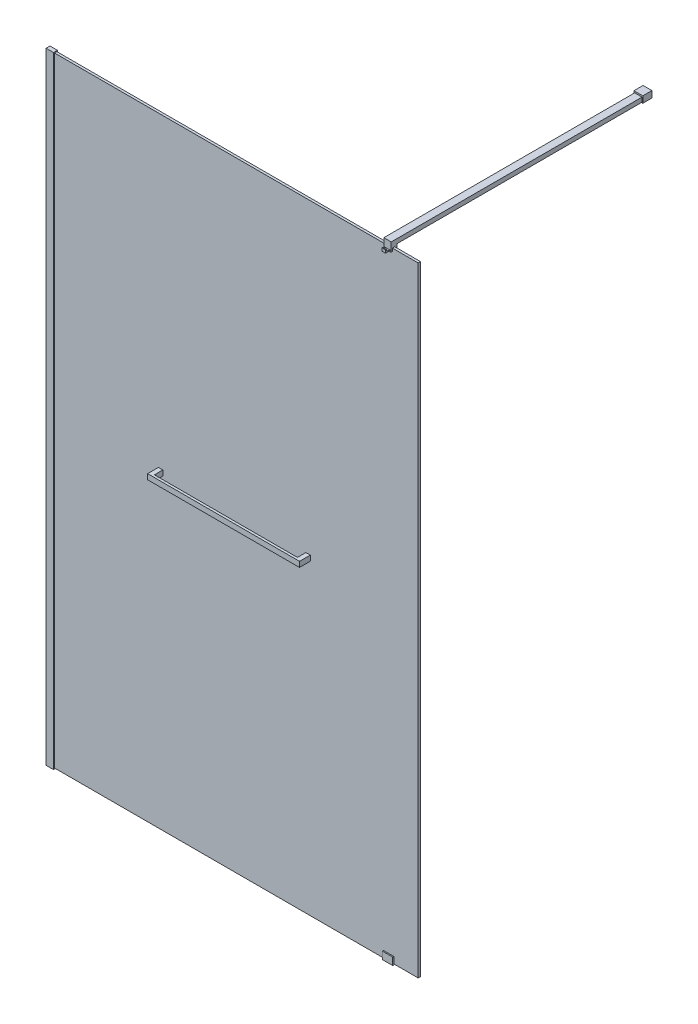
from build123d import *

# Parameters (mm, degrees)
DODANIE_WYCI_GNI_CIE1_DEPTH     = 2100
SZKIC2_W                        = 1247
SZKIC2_H                        = 8
DODANIE_WYCI_GNI_CIE2_DEPTH     = 2100
SZKIC4_W                        = 25
SZKIC4_H                        = 13.3
DODANIE_WYCI_GNI_CIE3_DEPTH     = 3
SZKIC5_W                        = 25
SZKIC5_H                        = 13.3
DODANIE_WYCI_GNI_CIE4_DEPTH     = 3
DODANIE_WYCI_GNI_CIE5_DEPTH     = 17.5
DODANIE_WYCI_GNI_CIE6_DEPTH     = 12.5
WYTNIJ_WYCI_GNI_CIE1_DEPTH      = 2451.853272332
WYTNIJ_WYCI_GNI_CIE1_DEPTH_BACK = 2451.853272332
SZKIC10_W                       = 25
SZKIC10_H                       = 861.63
DODANIE_WYCI_GNI_CIE7_DEPTH     = 15
SZKIC14_W                       = 30
SZKIC14_H                       = 22
DODANIE_WYCI_GNI_CIE8_DEPTH     = 31
POLKA_1A_DEPTH                  = 36.5
POLKA_1A_DEPTH_BACK             = 31
SZKIC17_W                       = 15
SZKIC17_H                       = 18
POLKA_1A_2_DEPTH                = 36.5
POLKA_1A_2_DEPTH_BACK           = 31
POLKA_1B_START                  = -515
SZKIC18_W                       = 12.8
SZKIC18_H                       = 8
POLKA_1B_DEPTH                  = 515
POLKA_1C_START                  = -5.28
SZKIC19_W                       = 515
SZKIC19_H                       = 80
POLKA_1C_DEPTH                  = 8
SZKIC20_W                       = 8
SZKIC20_H                       = 18
POLKA_1D_DEPTH                  = 485


with BuildPart() as part:
    # Szkic1 → Dodanie-wyci_gni_cie1 (new body)
    with BuildSketch(Plane(origin=(0, 0, 0), x_dir=(1, 0, 0), z_dir=(0, 1, 0))):
        Polygon((0, 0), (0, 13.3), (25, 13.3), (25, 11.4), (11.45, 11.4), (11.45, 3.4), (25, 3.4), (25, 0), align=None)
    extrude(amount=DODANIE_WYCI_GNI_CIE1_DEPTH)

    # Szkic4 → Dodanie-wyci_gni_cie3 (add)
    with BuildSketch(Plane(origin=(0, 2100, 0), x_dir=(1, 0, 0), z_dir=(0, 1, 0))):
        with Locations((12.5, 6.65)):
            Rectangle(SZKIC4_W, SZKIC4_H)
    extrude(amount=DODANIE_WYCI_GNI_CIE3_DEPTH)

    # Szkic5 → Dodanie-wyci_gni_cie4 (add)
    with BuildSketch(Plane.XZ):
        with Locations((12.5, -6.65)):
            Rectangle(SZKIC5_W, SZKIC5_H)
    extrude(amount=DODANIE_WYCI_GNI_CIE4_DEPTH)


with BuildPart() as body_2:
    # Szkic2 → Dodanie-wyci_gni_cie2 (new body)
    with BuildSketch(Plane.XZ):
        with Locations((634.95, -7.4)):
            Rectangle(SZKIC2_W, SZKIC2_H)
    extrude(amount=-DODANIE_WYCI_GNI_CIE2_DEPTH)


with BuildPart() as body_3:
    # Szkic6 → Dodanie-wyci_gni_cie5 (new, symmetric)
    with BuildSketch(Plane(origin=(1158.45, 0, 0), x_dir=(0, 0, -1), z_dir=(1, 0, 0))):
        Polygon((11.4, 22), (15.75, 22), (15.75, -3), (-0.35, -3), (-0.35, 22), (3.4, 22), (3.4, 0), (11.4, 0), align=None)
    extrude(amount=DODANIE_WYCI_GNI_CIE5_DEPTH, both=True)


with BuildPart() as body_4:
    # Szkic7 → Dodanie-wyci_gni_cie6 (new, symmetric)
    with BuildSketch(Plane(origin=(1158.45, 0, 0), x_dir=(0, 0, -1), z_dir=(1, 0, 0))):
        Polygon((-0.6, 2120), (19.4, 2120), (19.4, 2090), (11.4, 2090), (11.4, 2100), (3.4, 2100), (3.4, 2090), (-13.37, 2090), (-13.37, 2100), (-10.37, 2100), (-9.845068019, 2094), (-0.6, 2094), align=None)
    extrude(amount=DODANIE_WYCI_GNI_CIE6_DEPTH, both=True)

    # Szkic8 → Wytnij-wyci_gni_cie1 (cut, two sides: drawn at the far end of the back side and taken through both)
    with BuildSketch(Plane(origin=(0, 2100, 0), x_dir=(1, 0, 0), z_dir=(0, 1, 0)).offset(-WYTNIJ_WYCI_GNI_CIE1_DEPTH_BACK)):
        Polygon((-985.904859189, 993.500246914), (1145.95, -0.6), (1152.45, -3.630999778), (1152.45, -13.37), (1164.45, -13.37), (1164.45, -3.630999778), (1170.95, -0.6), (3302.804859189, 993.500246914), (3302.804859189, -3710.982909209), (-985.904859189, -3710.982909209), align=None)
    extrude(amount=WYTNIJ_WYCI_GNI_CIE1_DEPTH + WYTNIJ_WYCI_GNI_CIE1_DEPTH_BACK, mode=Mode.SUBTRACT)

    # Szkic10 → Dodanie-wyci_gni_cie7 (add)
    with BuildSketch(Plane(origin=(0, 2120, 0), x_dir=(1, 0, 0), z_dir=(0, 1, 0))):
        with Locations((1158.45, 450.215)):
            Rectangle(SZKIC10_W, SZKIC10_H)
    extrude(amount=-DODANIE_WYCI_GNI_CIE7_DEPTH)

    # Szkic14 → Dodanie-wyci_gni_cie8 (add)
    with BuildSketch(Plane(origin=(0, 0, -881.03), x_dir=(-1, 0, 0), z_dir=(0, 0, -1))):
        with Locations((-1158.45, 2114)):
            Rectangle(SZKIC14_W, SZKIC14_H)
    extrude(amount=-DODANIE_WYCI_GNI_CIE8_DEPTH)


with BuildPart() as body_5:
    # Szkic17 → polka_1a (new, two sides: drawn at the far end of the back side and taken through both)
    with BuildSketch(Plane.XY.offset(-3.4).offset(-POLKA_1A_DEPTH_BACK)):
        with Locations((384.95, 1050)):
            Rectangle(SZKIC17_W, SZKIC17_H)
    extrude(amount=POLKA_1A_DEPTH + POLKA_1A_DEPTH_BACK)


with BuildPart() as body_6:
    # Szkic17 → polka_1a 2 (new, two sides: drawn at the far end of the back side and taken through both)
    with BuildSketch(Plane.XY.offset(-3.4).offset(-POLKA_1A_2_DEPTH_BACK)):
        with Locations((884.95, 1050)):
            Rectangle(SZKIC17_W, SZKIC17_H)
    extrude(amount=POLKA_1A_2_DEPTH + POLKA_1A_2_DEPTH_BACK)


with BuildPart() as polka_1b_tool:
    # Szkic18 → polka_1b (new body)
    with BuildSketch(Plane.ZY.offset(-377.45).offset(POLKA_1B_START)):
        with Locations((-28, 1049.73)):
            Rectangle(SZKIC18_W, SZKIC18_H)
    extrude(amount=POLKA_1B_DEPTH)


with BuildPart() as body_5_1:
    add(body_5.part)

    # polka_1b: cut by polka_1b_tool
    add(polka_1b_tool.part, mode=Mode.SUBTRACT)



with BuildPart() as body_6_1:
    add(body_6.part)

    # polka_1b: cut by polka_1b_tool
    add(polka_1b_tool.part, mode=Mode.SUBTRACT)


with BuildPart() as body_7:
    # Szkic19 → polka_1c (new body)
    with BuildSketch(Plane(origin=(0, 1059, 0), x_dir=(1, 0, 0), z_dir=(0, 1, 0)).offset(POLKA_1C_START)):
        with Locations((634.95, 61.6)):
            Rectangle(SZKIC19_W, SZKIC19_H)
    extrude(amount=-POLKA_1C_DEPTH)


with BuildPart() as body_5_2:
    add(body_5_1.part)

    add(body_6_1.part)  # polka_1d merges body 6
    # Szkic20 → polka_1d (add)
    with BuildSketch(Plane(origin=(392.45, 0, 0), x_dir=(0, 0, -1), z_dir=(1, 0, 0))):
        with Locations((-29.1, 1050)):
            Rectangle(SZKIC20_W, SZKIC20_H)
    extrude(amount=POLKA_1D_DEPTH)


solid = Compound([part.part, body_2.part, body_3.part, body_4.part, body_7.part, body_5_2.part])
